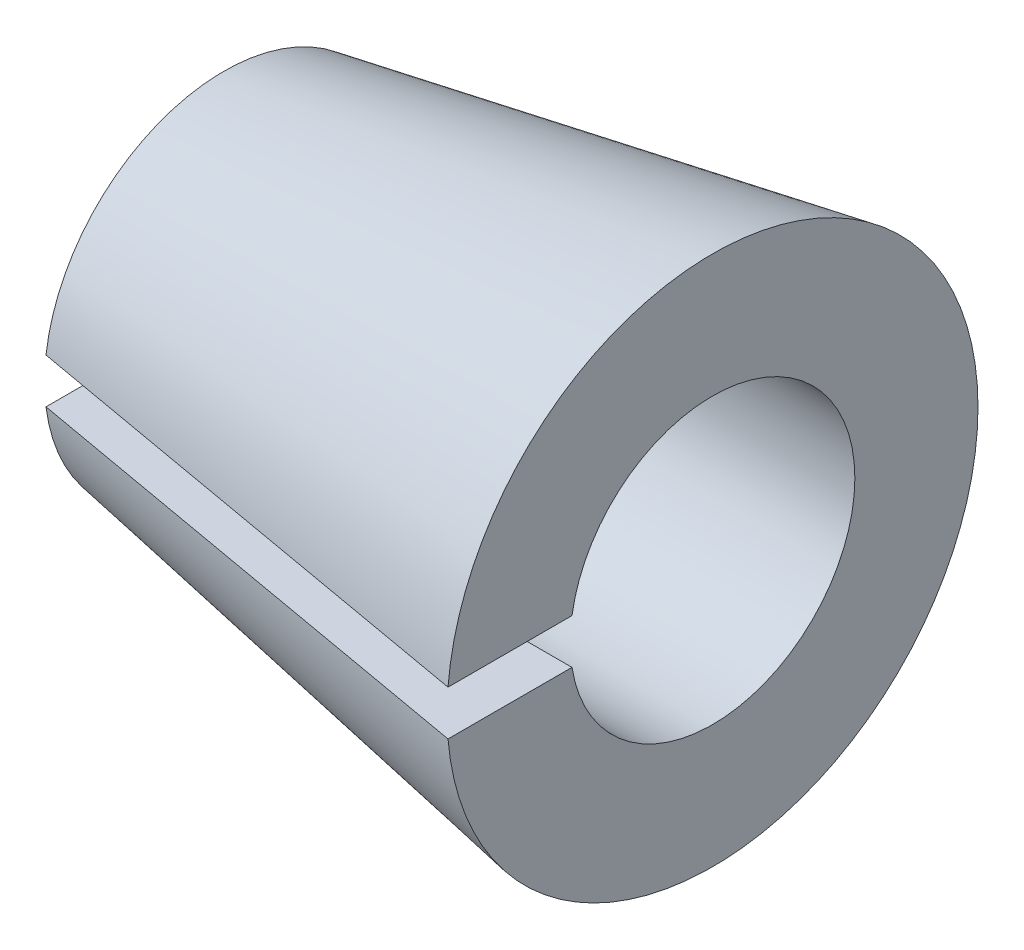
ISO-10303-21;
HEADER;
FILE_DESCRIPTION(('STEP AP214'),'2;1');
FILE_NAME('part.step','',(''),(''),'','','');
FILE_SCHEMA(('AUTOMOTIVE_DESIGN { 1 0 10303 214 1 1 1 1 }'));
ENDSEC;
DATA;
#1=APPLICATION_CONTEXT('core data for automotive mechanical design processes');
#2=APPLICATION_PROTOCOL_DEFINITION('international standard','automotive_design',2000,#1);
#3=PRODUCT_CONTEXT('',#1,'mechanical');
#4=PRODUCT('Part','Part','',(#3));
#5=PRODUCT_RELATED_PRODUCT_CATEGORY('part','',(#4));
#6=PRODUCT_DEFINITION_FORMATION('','',#4);
#7=PRODUCT_DEFINITION_CONTEXT('part definition',#1,'design');
#8=PRODUCT_DEFINITION('design','',#6,#7);
#9=PRODUCT_DEFINITION_SHAPE('','',#8);
#10=(LENGTH_UNIT() NAMED_UNIT(*) SI_UNIT(.MILLI.,.METRE.));
#11=(NAMED_UNIT(*) PLANE_ANGLE_UNIT() SI_UNIT($,.RADIAN.));
#12=(NAMED_UNIT(*) SI_UNIT($,.STERADIAN.) SOLID_ANGLE_UNIT());
#13=UNCERTAINTY_MEASURE_WITH_UNIT(LENGTH_MEASURE(1.E-05),#10,'distance_accuracy_value','');
#14=(GEOMETRIC_REPRESENTATION_CONTEXT(3) GLOBAL_UNCERTAINTY_ASSIGNED_CONTEXT((#13)) GLOBAL_UNIT_ASSIGNED_CONTEXT((#10,
#11,#12)) REPRESENTATION_CONTEXT('',''));
#15=CARTESIAN_POINT('',(0.,0.,0.));
#16=DIRECTION('',(0.,0.,1.));
#17=DIRECTION('',(1.,0.,0.));
#18=AXIS2_PLACEMENT_3D('',#15,#16,#17);
#19=CARTESIAN_POINT('',(0.,0.,0.));
#20=DIRECTION('',(-1.,0.,0.));
#21=DIRECTION('',(0.,0.,1.));
#22=AXIS2_PLACEMENT_3D('',#19,#20,#21);
#23=CYLINDRICAL_SURFACE('',#22,3.175);
#24=CARTESIAN_POINT('',(0.,0.,0.));
#25=DIRECTION('',(-1.,0.,0.));
#26=DIRECTION('',(0.,0.,1.));
#27=AXIS2_PLACEMENT_3D('',#24,#25,#26);
#28=CIRCLE('',#27,3.175);
#29=CARTESIAN_POINT('',(0.,0.5,3.13538275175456));
#30=VERTEX_POINT('',#29);
#31=CARTESIAN_POINT('',(0.,-0.5,3.13538275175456));
#32=VERTEX_POINT('',#31);
#33=EDGE_CURVE('E96',#30,#32,#28,.T.);
#34=ORIENTED_EDGE('',*,*,#33,.T.);
#35=DIRECTION('',(-1.,0.,0.));
#36=VECTOR('',#35,1.);
#37=CARTESIAN_POINT('',(0.,-0.5,3.13538275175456));
#38=LINE('',#37,#36);
#39=CARTESIAN_POINT('',(10.9,-0.5,3.13538275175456));
#40=VERTEX_POINT('',#39);
#41=EDGE_CURVE('E55',#32,#40,#38,.F.);
#42=ORIENTED_EDGE('',*,*,#41,.T.);
#43=CARTESIAN_POINT('',(10.9,0.,0.));
#44=DIRECTION('',(-1.,0.,0.));
#45=DIRECTION('',(0.,0.,1.));
#46=AXIS2_PLACEMENT_3D('',#43,#44,#45);
#47=CIRCLE('',#46,3.175);
#48=CARTESIAN_POINT('',(10.9,0.5,3.13538275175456));
#49=VERTEX_POINT('',#48);
#50=EDGE_CURVE('E85',#49,#40,#47,.T.);
#51=ORIENTED_EDGE('',*,*,#50,.F.);
#52=DIRECTION('',(-1.,0.,0.));
#53=VECTOR('',#52,1.);
#54=CARTESIAN_POINT('',(0.,0.5,3.13538275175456));
#55=LINE('',#54,#53);
#56=EDGE_CURVE('E70',#49,#30,#55,.T.);
#57=ORIENTED_EDGE('',*,*,#56,.T.);
#58=EDGE_LOOP('',(#34,#42,#51,#57));
#59=FACE_BOUND('',#58,.T.);
#60=ADVANCED_FACE('F33',(#59),#23,.F.);
#61=CARTESIAN_POINT('',(10.9,3.175,0.));
#62=DIRECTION('',(-1.,0.,0.));
#63=DIRECTION('',(0.,0.,1.));
#64=AXIS2_PLACEMENT_3D('',#61,#62,#63);
#65=PLANE('',#64);
#66=ORIENTED_EDGE('',*,*,#50,.T.);
#67=DIRECTION('',(0.,0.,-1.));
#68=VECTOR('',#67,1.);
#69=CARTESIAN_POINT('',(10.9,-0.5,0.));
#70=LINE('',#69,#68);
#71=CARTESIAN_POINT('',(10.9,-0.5,5.90081847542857));
#72=VERTEX_POINT('',#71);
#73=EDGE_CURVE('E88',#72,#40,#70,.T.);
#74=ORIENTED_EDGE('',*,*,#73,.F.);
#75=CARTESIAN_POINT('',(10.9,0.,0.));
#76=DIRECTION('',(-1.,0.,0.));
#77=DIRECTION('',(0.,0.,1.));
#78=AXIS2_PLACEMENT_3D('',#75,#76,#77);
#79=CIRCLE('',#78,5.92196408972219);
#80=CARTESIAN_POINT('',(10.9,0.5,5.90081847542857));
#81=VERTEX_POINT('',#80);
#82=EDGE_CURVE('E87',#81,#72,#79,.T.);
#83=ORIENTED_EDGE('',*,*,#82,.F.);
#84=DIRECTION('',(0.,0.,1.));
#85=VECTOR('',#84,1.);
#86=CARTESIAN_POINT('',(10.9,0.5,0.));
#87=LINE('',#86,#85);
#88=EDGE_CURVE('E73',#49,#81,#87,.T.);
#89=ORIENTED_EDGE('',*,*,#88,.F.);
#90=EDGE_LOOP('',(#66,#74,#83,#89));
#91=FACE_BOUND('',#90,.T.);
#92=ADVANCED_FACE('F83',(#91),#65,.F.);
#93=CARTESIAN_POINT('',(10.9,0.,0.));
#94=DIRECTION('',(1.,0.,0.));
#95=DIRECTION('',(0.,0.,-1.));
#96=AXIS2_PLACEMENT_3D('',#93,#94,#95);
#97=CONICAL_SURFACE('',#96,5.92196408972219,0.174532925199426);
#98=ORIENTED_EDGE('',*,*,#82,.T.);
#99=CARTESIAN_POINT('',(-5.72336489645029,-0.5,2.94872556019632));
#100=CARTESIAN_POINT('',(-4.88719323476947,-0.5,3.09825334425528));
#101=CARTESIAN_POINT('',(-4.05097252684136,-0.5,3.24750640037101));
#102=CARTESIAN_POINT('',(-2.37845800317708,-0.5,3.54560200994));
#103=CARTESIAN_POINT('',(-1.54216418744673,-0.5,3.69444456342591));
#104=CARTESIAN_POINT('',(-0.00317854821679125,-0.5,3.96809361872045));
#105=CARTESIAN_POINT('',(0.699506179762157,-0.5,4.09294004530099));
#106=CARTESIAN_POINT('',(2.58990649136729,-0.5,4.42860440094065));
#107=CARTESIAN_POINT('',(3.77764633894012,-0.5,4.6392856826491));
#108=CARTESIAN_POINT('',(6.15317466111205,-0.5,5.0603740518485));
#109=CARTESIAN_POINT('',(7.34096313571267,-0.5,5.27078113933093));
#110=CARTESIAN_POINT('',(10.5376290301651,-0.5,5.83678178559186));
#111=CARTESIAN_POINT('',(12.5465376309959,-0.5,6.19219923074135));
#112=CARTESIAN_POINT('',(16.5644105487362,-0.5,6.9027191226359));
#113=CARTESIAN_POINT('',(18.5733748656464,-0.5,7.25782156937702));
#114=CARTESIAN_POINT('',(22.5913388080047,-0.5,7.96782411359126));
#115=CARTESIAN_POINT('',(24.6003384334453,-0.5,8.32272421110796));
#116=CARTESIAN_POINT('',(28.6183626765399,-0.5,9.03238258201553));
#117=CARTESIAN_POINT('',(30.6273872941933,-0.5,9.38714085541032));
#118=CARTESIAN_POINT('',(32.6364190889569,-0.5,9.74185845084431));
#119=B_SPLINE_CURVE_WITH_KNOTS('',3,(#99,#100,#101,#102,#103,#104,#105,#106,#107,#108,#109,#110,
#111,#112,#113,#114,#115,#116,#117,#118),.UNSPECIFIED.,.F.,.F.,(4,2,2,2,2,2,2,2,2,4),(0.,
2.54830799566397,5.0966157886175,7.23768376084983,10.8565250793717,14.4753665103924,
20.5956865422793,26.7160066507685,32.8363254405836,38.9566440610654),.UNSPECIFIED.);
#120=CARTESIAN_POINT('',(0.,-0.5,3.96862696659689));
#121=VERTEX_POINT('',#120);
#122=EDGE_CURVE('E78',#72,#121,#119,.F.);
#123=ORIENTED_EDGE('',*,*,#122,.T.);
#124=CARTESIAN_POINT('',(0.,0.,0.));
#125=DIRECTION('',(-1.,0.,0.));
#126=DIRECTION('',(0.,0.,1.));
#127=AXIS2_PLACEMENT_3D('',#124,#125,#126);
#128=CIRCLE('',#127,4.);
#129=CARTESIAN_POINT('',(0.,0.5,3.96862696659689));
#130=VERTEX_POINT('',#129);
#131=EDGE_CURVE('E91',#130,#121,#128,.T.);
#132=ORIENTED_EDGE('',*,*,#131,.F.);
#133=CARTESIAN_POINT('',(-5.72336489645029,0.5,2.94872556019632));
#134=CARTESIAN_POINT('',(-4.88719323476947,0.5,3.09825334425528));
#135=CARTESIAN_POINT('',(-4.05097252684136,0.5,3.24750640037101));
#136=CARTESIAN_POINT('',(-2.37845800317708,0.5,3.54560200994));
#137=CARTESIAN_POINT('',(-1.54216418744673,0.5,3.69444456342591));
#138=CARTESIAN_POINT('',(-0.00317854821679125,0.5,3.96809361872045));
#139=CARTESIAN_POINT('',(0.699506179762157,0.5,4.09294004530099));
#140=CARTESIAN_POINT('',(2.58990649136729,0.5,4.42860440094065));
#141=CARTESIAN_POINT('',(3.77764633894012,0.5,4.6392856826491));
#142=CARTESIAN_POINT('',(6.15317466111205,0.5,5.0603740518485));
#143=CARTESIAN_POINT('',(7.34096313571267,0.5,5.27078113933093));
#144=CARTESIAN_POINT('',(10.5376290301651,0.5,5.83678178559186));
#145=CARTESIAN_POINT('',(12.5465376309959,0.5,6.19219923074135));
#146=CARTESIAN_POINT('',(16.5644105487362,0.5,6.9027191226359));
#147=CARTESIAN_POINT('',(18.5733748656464,0.5,7.25782156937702));
#148=CARTESIAN_POINT('',(22.5913388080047,0.5,7.96782411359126));
#149=CARTESIAN_POINT('',(24.6003384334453,0.5,8.32272421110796));
#150=CARTESIAN_POINT('',(28.6183626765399,0.5,9.03238258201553));
#151=CARTESIAN_POINT('',(30.6273872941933,0.5,9.38714085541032));
#152=CARTESIAN_POINT('',(32.6364190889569,0.5,9.74185845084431));
#153=B_SPLINE_CURVE_WITH_KNOTS('',3,(#133,#134,#135,#136,#137,#138,#139,#140,#141,#142,#143,
#144,#145,#146,#147,#148,#149,#150,#151,#152),.UNSPECIFIED.,.F.,.F.,(4,2,2,2,2,2,2,2,2,4),(0.,
2.54830799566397,5.0966157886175,7.23768376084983,10.8565250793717,14.4753665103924,
20.5956865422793,26.7160066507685,32.8363254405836,38.9566440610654),.UNSPECIFIED.);
#154=EDGE_CURVE('E47',#130,#81,#153,.T.);
#155=ORIENTED_EDGE('',*,*,#154,.T.);
#156=EDGE_LOOP('',(#98,#123,#132,#155));
#157=FACE_BOUND('',#156,.T.);
#158=ADVANCED_FACE('F109',(#157),#97,.T.);
#159=CARTESIAN_POINT('',(0.,4.,0.));
#160=DIRECTION('',(1.,0.,0.));
#161=DIRECTION('',(0.,0.,-1.));
#162=AXIS2_PLACEMENT_3D('',#159,#160,#161);
#163=PLANE('',#162);
#164=ORIENTED_EDGE('',*,*,#131,.T.);
#165=DIRECTION('',(0.,0.,-1.));
#166=VECTOR('',#165,1.);
#167=CARTESIAN_POINT('',(0.,-0.5,0.));
#168=LINE('',#167,#166);
#169=EDGE_CURVE('E11',#121,#32,#168,.T.);
#170=ORIENTED_EDGE('',*,*,#169,.T.);
#171=ORIENTED_EDGE('',*,*,#33,.F.);
#172=DIRECTION('',(0.,0.,1.));
#173=VECTOR('',#172,1.);
#174=CARTESIAN_POINT('',(0.,0.5,0.));
#175=LINE('',#174,#173);
#176=EDGE_CURVE('E40',#30,#130,#175,.T.);
#177=ORIENTED_EDGE('',*,*,#176,.T.);
#178=EDGE_LOOP('',(#164,#170,#171,#177));
#179=FACE_BOUND('',#178,.T.);
#180=ADVANCED_FACE('F113',(#179),#163,.F.);
#181=CARTESIAN_POINT('',(0.,0.5,0.));
#182=DIRECTION('',(0.,1.,0.));
#183=DIRECTION('',(0.,0.,1.));
#184=AXIS2_PLACEMENT_3D('',#181,#182,#183);
#185=PLANE('',#184);
#186=ORIENTED_EDGE('',*,*,#88,.T.);
#187=ORIENTED_EDGE('',*,*,#154,.F.);
#188=ORIENTED_EDGE('',*,*,#176,.F.);
#189=ORIENTED_EDGE('',*,*,#56,.F.);
#190=EDGE_LOOP('',(#186,#187,#188,#189));
#191=FACE_BOUND('',#190,.T.);
#192=ADVANCED_FACE('F72',(#191),#185,.F.);
#193=CARTESIAN_POINT('',(0.,-0.5,0.));
#194=DIRECTION('',(0.,-1.,0.));
#195=DIRECTION('',(0.,0.,-1.));
#196=AXIS2_PLACEMENT_3D('',#193,#194,#195);
#197=PLANE('',#196);
#198=ORIENTED_EDGE('',*,*,#169,.F.);
#199=ORIENTED_EDGE('',*,*,#122,.F.);
#200=ORIENTED_EDGE('',*,*,#73,.T.);
#201=ORIENTED_EDGE('',*,*,#41,.F.);
#202=EDGE_LOOP('',(#198,#199,#200,#201));
#203=FACE_BOUND('',#202,.T.);
#204=ADVANCED_FACE('F106',(#203),#197,.F.);
#205=CLOSED_SHELL('',(#60,#92,#158,#180,#192,#204));
#206=MANIFOLD_SOLID_BREP('B2',#205);
#207=ADVANCED_BREP_SHAPE_REPRESENTATION('',(#18,#206),#14);
#208=SHAPE_DEFINITION_REPRESENTATION(#9,#207);
ENDSEC;
END-ISO-10303-21;
